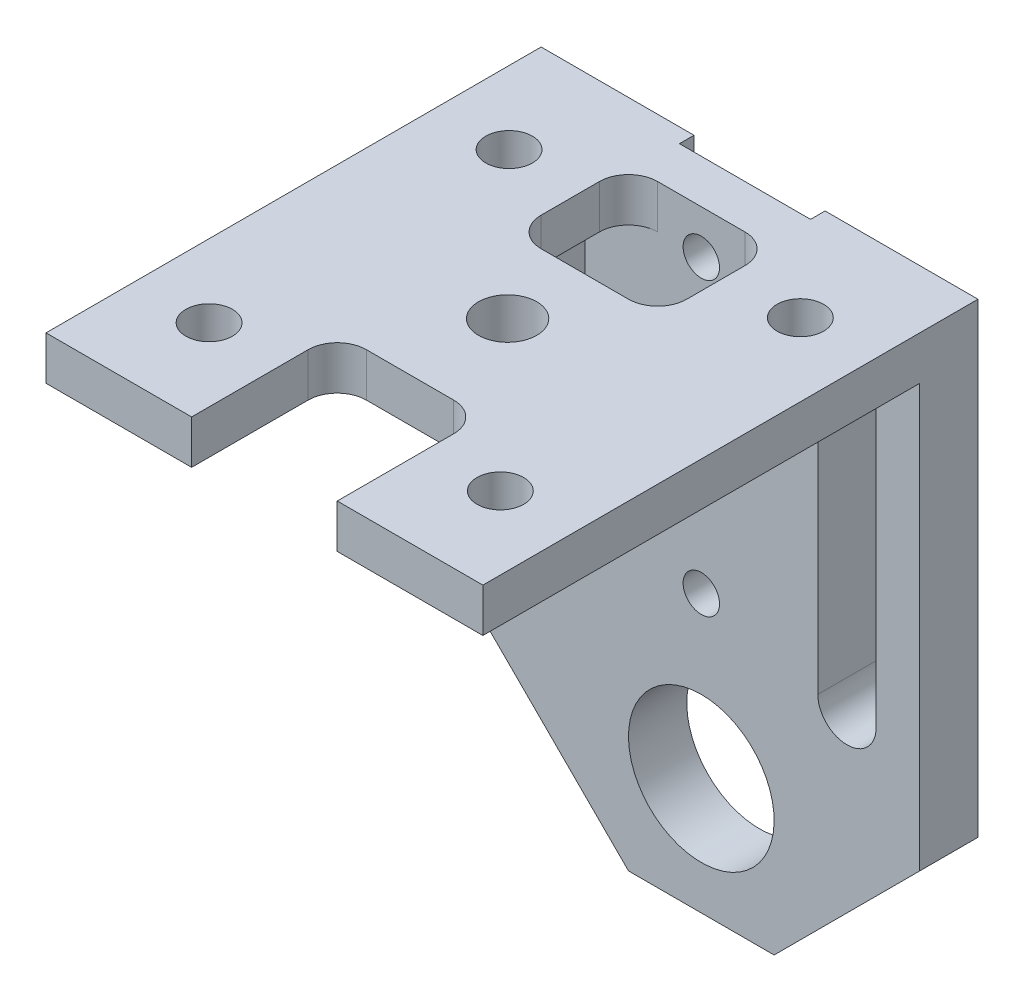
from build123d import *

# Parameters (mm, degrees)
EXTRUDE_1_DEPTH        = 30
SKETCH_2_R             = 5
CUT_EXTRUDE_2_DEPTH    = 30
SKETCH_3_R             = 1.6
CUT_EXTRUDE_3_DEPTH    = 4
CUT_EXTRUDE_5_REACH    = 63.806
SKETCH_19_W            = 9
SKETCH_19_H            = 28
CUT_EXTRUDE_6_DEPTH    = 1
HOLE_WIZARD_M3_2_D     = 2.5
HOLE_WIZARD_M3_2_DEPTH = 8.5
HOLE_WIZARD_M3_2_TIP   = 0.751075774
FILLET_5_R             = 1
CUT_EXTRUDE_8_REACH    = 61.808
FILLET_6_R             = 2
FILLET_7_R             = 2
CUT_EXTRUDE_10_DEPTH   = 10
CHAMFER_1_SIZE         = 10
HOLE_WIZARD_4_0_4_1_D  = 4


with BuildPart() as part:
    # Sketch 1 → Extrude 1 (new body)
    with BuildSketch(Plane(origin=(0, 0, 0), x_dir=(0, 0, -1), z_dir=(1, 0, 0))):
        Polygon((0, 0), (30, 0), (30, -39), (34, -39), (34, 3), (0, 3), align=None)
    extrude(amount=EXTRUDE_1_DEPTH)

    # Sketch 2 → Cut-Extrude 2 (cut)
    with BuildSketch(Plane(origin=(0, 0, -34), x_dir=(-1, 0, 0), z_dir=(0, 0, -1))):
        with Locations(Location((-15, -31, 0), (0, 0, 90))):
            Circle(SKETCH_2_R)
    extrude(amount=-CUT_EXTRUDE_2_DEPTH, mode=Mode.SUBTRACT)

    # Sketch 3 → Cut-Extrude 3 (cut)
    with BuildSketch(Plane(origin=(0, 3, 0), x_dir=(1, 0, 0), z_dir=(0, 1, 0))):
        with Locations(Location((25, 26.8, 0), (0, 0, 270))):
            Circle(SKETCH_3_R)
        with Locations(Location((25, 6.2, 0), (0, 0, 270))):
            Circle(SKETCH_3_R)
        with Locations(Location((5, 6.2, 0), (0, 0, 270))):
            Circle(SKETCH_3_R)
        with Locations(Location((5, 26.8, 0), (0, 0, 270))):
            Circle(SKETCH_3_R)
    extrude(amount=-CUT_EXTRUDE_3_DEPTH, mode=Mode.SUBTRACT)

    # Sketch 17 → Cut-Extrude 5 (cut, up to next)
    with BuildSketch(Plane(origin=(0, 3, 0), x_dir=(1, 0, 0), z_dir=(0, 1, 0)), mode=Mode.PRIVATE) as cut_extrude_5_sk1:
        Polygon((15, 0), (20, 0), (20, 10), (10, 10), (10, 0), align=None)
    cut_extrude_5_tool1 = extrude(cut_extrude_5_sk1.sketch, amount=-CUT_EXTRUDE_5_REACH, mode=Mode.PRIVATE) & part.part
    add(cut_extrude_5_tool1.solids().sort_by_distance((15, 3, -5))[0], mode=Mode.SUBTRACT)

    # Sketch 19 → Cut-Extrude 6 (cut)
    with BuildSketch(Plane(origin=(0, 0, -34), x_dir=(-1, 0, 0), z_dir=(0, 0, -1))):
        with Locations((-15, -11)):
            Rectangle(SKETCH_19_W, SKETCH_19_H)
    extrude(amount=-CUT_EXTRUDE_6_DEPTH, mode=Mode.SUBTRACT)

    # Hole Wizard M3 _2
    with Locations(Plane(origin=(0, 0, -33), x_dir=(-1, 0, 0), z_dir=(0, 0, -1))):
        with Locations((-15, -20), (-15, 0)):
            Hole(HOLE_WIZARD_M3_2_D / 2, depth=HOLE_WIZARD_M3_2_DEPTH)
            with Locations((0, 0, -(HOLE_WIZARD_M3_2_DEPTH + HOLE_WIZARD_M3_2_TIP / 2))):  # 118° drill point
                Cone(0, HOLE_WIZARD_M3_2_D / 2, HOLE_WIZARD_M3_2_TIP, mode=Mode.SUBTRACT)

    # Fillet 5
    fillet_5_edges = [part.edges().sort_by_distance(p)[0] for p in [
        (19.5, -25, -33.5),
        (10.5, -25, -33.5),
    ]]
    fillet(fillet_5_edges, radius=FILLET_5_R)

    # Sketch 27 → Cut-Extrude 8 (cut, up to next)
    with BuildSketch(Plane.XZ, mode=Mode.PRIVATE) as cut_extrude_8_sk1:
        Polygon((15, -22), (20, -22), (20, -30), (10, -30), (10, -22), align=None)
    cut_extrude_8_tool1 = extrude(cut_extrude_8_sk1.sketch, amount=-CUT_EXTRUDE_8_REACH, mode=Mode.PRIVATE) & part.part
    add(cut_extrude_8_tool1.solids().sort_by_distance((15, 0, -26))[0], mode=Mode.SUBTRACT)

    # Fillet 6
    fillet_6_edges = [part.edges().sort_by_distance(p)[0] for p in [
        (10, 1.5, -22),
        (20, 1.5, -22),
    ]]
    fillet(fillet_6_edges, radius=FILLET_6_R)

    # Fillet 7
    fillet_7_edges = [part.edges().sort_by_distance(p)[0] for p in [
        (10, 1.5, -30),
        (20, 1.5, -30),
        (10, 1.5, -10),
        (20, 1.5, -10),
    ]]
    fillet(fillet_7_edges, radius=FILLET_7_R)

    # Sketch 30 → Cut-Extrude 10 (cut)
    with BuildSketch(Plane(origin=(0, 0, -34), x_dir=(-1, 0, 0), z_dir=(0, 0, -1))):
        with BuildLine():
            Line((-27, -3), (-27, -22))
            ThreePointArc((-27, -22), (-25, -24), (-23, -22))
            Line((-23, -22), (-23, -3))
            ThreePointArc((-23, -3), (-25, -1), (-27, -3))
        make_face()
        with BuildLine():
            Line((-3, -3), (-3, -22))
            ThreePointArc((-3, -22), (-5, -24), (-7, -22))
            Line((-7, -22), (-7, -3))
            ThreePointArc((-7, -3), (-5, -1), (-3, -3))
        make_face()
    extrude(amount=-CUT_EXTRUDE_10_DEPTH, mode=Mode.SUBTRACT)

    # Chamfer 1
    chamfer_1_edges = [part.edges().sort_by_distance(p)[0] for p in [
        (30, -39, -32),
        (0, -39, -32),
    ]]
    chamfer(chamfer_1_edges, length=CHAMFER_1_SIZE)

    # Hole Wizard 4.0 _4_ _1 (through all)
    with Locations(Plane(origin=(15, 0, -16.7), x_dir=(0, 0, -1), z_dir=(0, -1, 0))):
        with Locations((0, 0)):
            Hole(HOLE_WIZARD_4_0_4_1_D / 2)


solid = part.part
